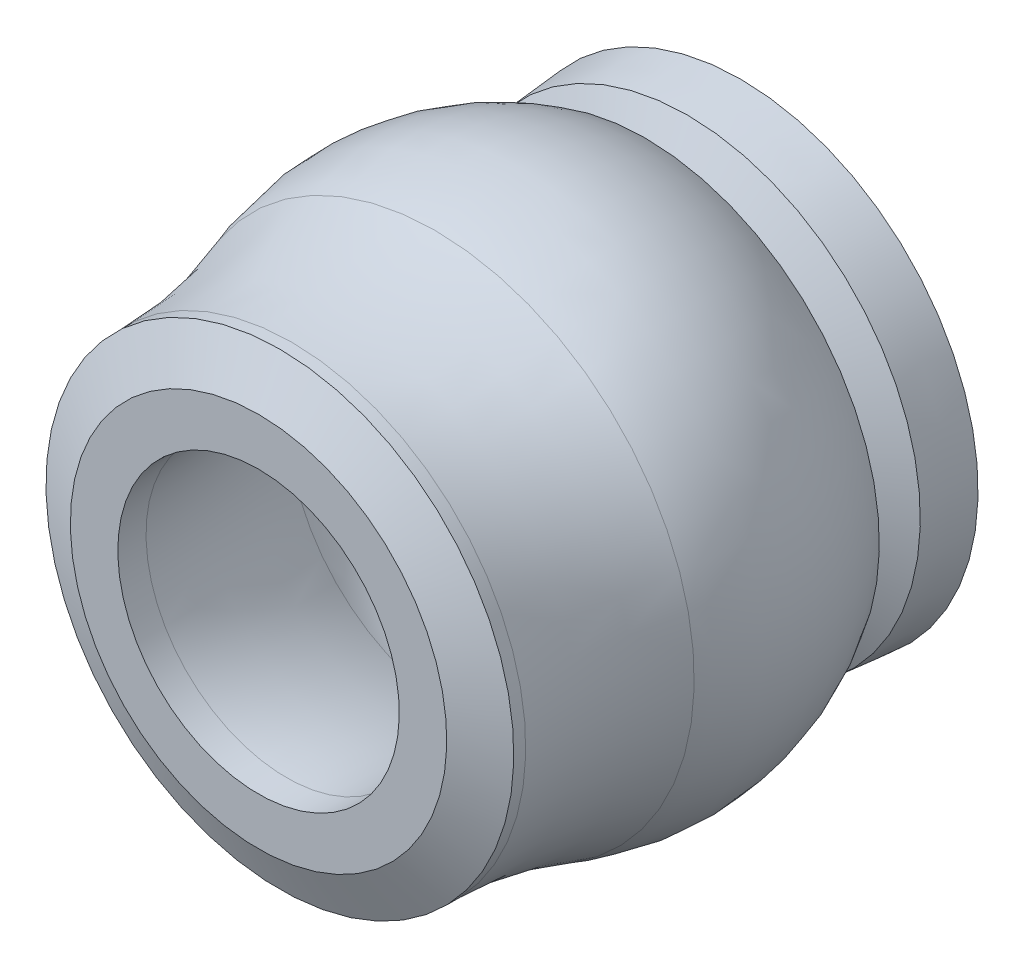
ISO-10303-21;
HEADER;
FILE_DESCRIPTION(('STEP AP214'),'2;1');
FILE_NAME('part.step','',(''),(''),'','','');
FILE_SCHEMA(('AUTOMOTIVE_DESIGN { 1 0 10303 214 1 1 1 1 }'));
ENDSEC;
DATA;
#1=APPLICATION_CONTEXT('core data for automotive mechanical design processes');
#2=APPLICATION_PROTOCOL_DEFINITION('international standard','automotive_design',2000,#1);
#3=PRODUCT_CONTEXT('',#1,'mechanical');
#4=PRODUCT('Part','Part','',(#3));
#5=PRODUCT_RELATED_PRODUCT_CATEGORY('part','',(#4));
#6=PRODUCT_DEFINITION_FORMATION('','',#4);
#7=PRODUCT_DEFINITION_CONTEXT('part definition',#1,'design');
#8=PRODUCT_DEFINITION('design','',#6,#7);
#9=PRODUCT_DEFINITION_SHAPE('','',#8);
#10=(LENGTH_UNIT() NAMED_UNIT(*) SI_UNIT(.MILLI.,.METRE.));
#11=(NAMED_UNIT(*) PLANE_ANGLE_UNIT() SI_UNIT($,.RADIAN.));
#12=(NAMED_UNIT(*) SI_UNIT($,.STERADIAN.) SOLID_ANGLE_UNIT());
#13=UNCERTAINTY_MEASURE_WITH_UNIT(LENGTH_MEASURE(1.E-05),#10,'distance_accuracy_value','');
#14=(GEOMETRIC_REPRESENTATION_CONTEXT(3) GLOBAL_UNCERTAINTY_ASSIGNED_CONTEXT((#13)) GLOBAL_UNIT_ASSIGNED_CONTEXT((#10,
#11,#12)) REPRESENTATION_CONTEXT('',''));
#15=CARTESIAN_POINT('',(0.,0.,0.));
#16=DIRECTION('',(0.,0.,1.));
#17=DIRECTION('',(1.,0.,0.));
#18=AXIS2_PLACEMENT_3D('',#15,#16,#17);
#19=CARTESIAN_POINT('',(0.,0.,7.8471037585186));
#20=DIRECTION('',(0.,0.,-1.));
#21=DIRECTION('',(0.,1.,0.));
#22=AXIS2_PLACEMENT_3D('',#19,#20,#21);
#23=TOROIDAL_SURFACE('',#22,11.684,1.524);
#24=CARTESIAN_POINT('',(0.,0.,7.8471037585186));
#25=DIRECTION('',(0.,0.,-1.));
#26=DIRECTION('',(0.,1.,0.));
#27=AXIS2_PLACEMENT_3D('',#24,#25,#26);
#28=CIRCLE('',#27,10.16);
#29=CARTESIAN_POINT('',(0.,10.16,7.8471037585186));
#30=VERTEX_POINT('',#29);
#31=EDGE_CURVE('E97',#30,#30,#28,.T.);
#32=ORIENTED_EDGE('',*,*,#31,.T.);
#33=EDGE_LOOP('',(#32));
#34=FACE_BOUND('',#33,.T.);
#35=CARTESIAN_POINT('',(0.,0.,8.77564605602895));
#36=DIRECTION('',(0.,0.,-1.));
#37=DIRECTION('',(0.,1.,0.));
#38=AXIS2_PLACEMENT_3D('',#35,#36,#37);
#39=CIRCLE('',#38,10.4755360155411);
#40=CARTESIAN_POINT('',(0.,10.4755360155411,8.77564605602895));
#41=VERTEX_POINT('',#40);
#42=EDGE_CURVE('E158',#41,#41,#39,.F.);
#43=ORIENTED_EDGE('',*,*,#42,.T.);
#44=EDGE_LOOP('',(#43));
#45=FACE_BOUND('',#44,.T.);
#46=ADVANCED_FACE('F12',(#34,#45),#23,.T.);
#47=CARTESIAN_POINT('',(0.,0.740127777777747,16.256));
#48=DIRECTION('',(1.,0.,0.));
#49=DIRECTION('',(0.,1.,0.));
#50=AXIS2_PLACEMENT_3D('',#47,#48,#49);
#51=CIRCLE('',#50,12.2773722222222);
#52=TRIMMED_CURVE('',#51,(PARAMETER_VALUE(-1.63111679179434)),
(PARAMETER_VALUE(1.63111679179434)),.T.,.PARAMETER.);
#53=CARTESIAN_POINT('',(0.,0.,16.256));
#54=DIRECTION('',(0.,0.,-1.));
#55=AXIS1_PLACEMENT('',#53,#54);
#56=SURFACE_OF_REVOLUTION('',#52,#55);
#57=ORIENTED_EDGE('',*,*,#42,.F.);
#58=EDGE_LOOP('',(#57));
#59=FACE_BOUND('',#58,.T.);
#60=CARTESIAN_POINT('',(0.,0.,20.3829451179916));
#61=DIRECTION('',(0.,0.,-1.));
#62=DIRECTION('',(0.,1.,0.));
#63=AXIS2_PLACEMENT_3D('',#60,#61,#62);
#64=CIRCLE('',#63,12.3030942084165);
#65=CARTESIAN_POINT('',(0.,12.3030942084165,20.3829451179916));
#66=VERTEX_POINT('',#65);
#67=EDGE_CURVE('E94',#66,#66,#64,.T.);
#68=ORIENTED_EDGE('',*,*,#67,.F.);
#69=EDGE_LOOP('',(#68));
#70=FACE_BOUND('',#69,.T.);
#71=ADVANCED_FACE('F101',(#59,#70),#56,.T.);
#72=CARTESIAN_POINT('',(0.,0.,-13.2937769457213));
#73=DIRECTION('',(0.,0.,-1.));
#74=DIRECTION('',(0.,1.,0.));
#75=AXIS2_PLACEMENT_3D('',#72,#73,#74);
#76=CYLINDRICAL_SURFACE('',#75,10.16);
#77=CARTESIAN_POINT('',(0.,0.,7.58440075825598));
#78=DIRECTION('',(0.,0.,1.));
#79=DIRECTION('',(0.,-1.,0.));
#80=AXIS2_PLACEMENT_3D('',#77,#78,#79);
#81=CIRCLE('',#80,10.16);
#82=CARTESIAN_POINT('',(0.,-10.16,7.58440075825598));
#83=VERTEX_POINT('',#82);
#84=EDGE_CURVE('E91',#83,#83,#81,.F.);
#85=ORIENTED_EDGE('',*,*,#84,.T.);
#86=EDGE_LOOP('',(#85));
#87=FACE_BOUND('',#86,.T.);
#88=ORIENTED_EDGE('',*,*,#31,.F.);
#89=EDGE_LOOP('',(#88));
#90=FACE_BOUND('',#89,.T.);
#91=ADVANCED_FACE('F84',(#87,#90),#76,.F.);
#92=CARTESIAN_POINT('',(0.,0.,32.7630689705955));
#93=DIRECTION('',(0.,0.,-1.));
#94=DIRECTION('',(0.,1.,0.));
#95=AXIS2_PLACEMENT_3D('',#92,#93,#94);
#96=TOROIDAL_SURFACE('',#95,46.99,36.83);
#97=ORIENTED_EDGE('',*,*,#67,.T.);
#98=EDGE_LOOP('',(#97));
#99=FACE_BOUND('',#98,.T.);
#100=CARTESIAN_POINT('',(0.,0.,32.7630689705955));
#101=DIRECTION('',(0.,0.,-1.));
#102=DIRECTION('',(0.,1.,0.));
#103=AXIS2_PLACEMENT_3D('',#100,#101,#102);
#104=CIRCLE('',#103,10.16);
#105=CARTESIAN_POINT('',(0.,10.16,32.7630689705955));
#106=VERTEX_POINT('',#105);
#107=EDGE_CURVE('E89',#106,#106,#104,.F.);
#108=ORIENTED_EDGE('',*,*,#107,.T.);
#109=EDGE_LOOP('',(#108));
#110=FACE_BOUND('',#109,.T.);
#111=ADVANCED_FACE('F79',(#99,#110),#96,.T.);
#112=CARTESIAN_POINT('',(0.,0.,7.58440075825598));
#113=DIRECTION('',(0.,0.,1.));
#114=DIRECTION('',(0.,-1.,0.));
#115=AXIS2_PLACEMENT_3D('',#112,#113,#114);
#116=CONICAL_SURFACE('',#115,10.16,1.13446401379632);
#117=ORIENTED_EDGE('',*,*,#84,.F.);
#118=EDGE_LOOP('',(#117));
#119=FACE_BOUND('',#118,.T.);
#120=CARTESIAN_POINT('',(0.,0.,5.334));
#121=DIRECTION('',(0.,0.,-1.));
#122=DIRECTION('',(0.,1.,0.));
#123=AXIS2_PLACEMENT_3D('',#120,#121,#122);
#124=CIRCLE('',#123,5.334);
#125=CARTESIAN_POINT('',(0.,5.334,5.334));
#126=VERTEX_POINT('',#125);
#127=EDGE_CURVE('E138',#126,#126,#124,.T.);
#128=ORIENTED_EDGE('',*,*,#127,.T.);
#129=EDGE_LOOP('',(#128));
#130=FACE_BOUND('',#129,.T.);
#131=ADVANCED_FACE('F75',(#119,#130),#116,.F.);
#132=CARTESIAN_POINT('',(0.,0.,-13.2937769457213));
#133=DIRECTION('',(0.,0.,-1.));
#134=DIRECTION('',(0.,1.,0.));
#135=AXIS2_PLACEMENT_3D('',#132,#133,#134);
#136=CYLINDRICAL_SURFACE('',#135,10.16);
#137=ORIENTED_EDGE('',*,*,#107,.F.);
#138=EDGE_LOOP('',(#137));
#139=FACE_BOUND('',#138,.T.);
#140=CARTESIAN_POINT('',(0.,0.,34.798));
#141=DIRECTION('',(0.,0.,-1.));
#142=DIRECTION('',(0.,1.,0.));
#143=AXIS2_PLACEMENT_3D('',#140,#141,#142);
#144=CIRCLE('',#143,10.16);
#145=CARTESIAN_POINT('',(0.,10.16,34.798));
#146=VERTEX_POINT('',#145);
#147=EDGE_CURVE('E16',#146,#146,#144,.T.);
#148=ORIENTED_EDGE('',*,*,#147,.F.);
#149=EDGE_LOOP('',(#148));
#150=FACE_BOUND('',#149,.T.);
#151=ADVANCED_FACE('F71',(#139,#150),#136,.F.);
#152=CARTESIAN_POINT('',(0.,0.,-13.2937769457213));
#153=DIRECTION('',(0.,0.,-1.));
#154=DIRECTION('',(0.,1.,0.));
#155=AXIS2_PLACEMENT_3D('',#152,#153,#154);
#156=CYLINDRICAL_SURFACE('',#155,5.334);
#157=CARTESIAN_POINT('',(0.,0.,0.));
#158=DIRECTION('',(0.,0.,-1.));
#159=DIRECTION('',(0.,1.,0.));
#160=AXIS2_PLACEMENT_3D('',#157,#158,#159);
#161=CIRCLE('',#160,5.334);
#162=CARTESIAN_POINT('',(0.,5.334,0.));
#163=VERTEX_POINT('',#162);
#164=EDGE_CURVE('E143',#163,#163,#161,.F.);
#165=ORIENTED_EDGE('',*,*,#164,.F.);
#166=EDGE_LOOP('',(#165));
#167=FACE_BOUND('',#166,.T.);
#168=ORIENTED_EDGE('',*,*,#127,.F.);
#169=EDGE_LOOP('',(#168));
#170=FACE_BOUND('',#169,.T.);
#171=ADVANCED_FACE('F67',(#167,#170),#156,.F.);
#172=CARTESIAN_POINT('',(13.589,0.,34.798));
#173=DIRECTION('',(0.,0.,1.));
#174=DIRECTION('',(0.,-1.,0.));
#175=AXIS2_PLACEMENT_3D('',#172,#173,#174);
#176=PLANE('',#175);
#177=CARTESIAN_POINT('',(0.,0.,34.798));
#178=DIRECTION('',(0.,0.,-1.));
#179=DIRECTION('',(0.,1.,0.));
#180=AXIS2_PLACEMENT_3D('',#177,#178,#179);
#181=CIRCLE('',#180,13.589);
#182=CARTESIAN_POINT('',(0.,13.589,34.798));
#183=VERTEX_POINT('',#182);
#184=EDGE_CURVE('E151',#183,#183,#181,.T.);
#185=ORIENTED_EDGE('',*,*,#184,.F.);
#186=EDGE_LOOP('',(#185));
#187=FACE_BOUND('',#186,.T.);
#188=ORIENTED_EDGE('',*,*,#147,.T.);
#189=EDGE_LOOP('',(#188));
#190=FACE_BOUND('',#189,.T.);
#191=ADVANCED_FACE('F63',(#187,#190),#176,.T.);
#192=CARTESIAN_POINT('',(5.334,0.,0.));
#193=DIRECTION('',(0.,0.,-1.));
#194=DIRECTION('',(0.,1.,0.));
#195=AXIS2_PLACEMENT_3D('',#192,#193,#194);
#196=PLANE('',#195);
#197=ORIENTED_EDGE('',*,*,#164,.T.);
#198=EDGE_LOOP('',(#197));
#199=FACE_BOUND('',#198,.T.);
#200=CARTESIAN_POINT('',(0.,0.,0.));
#201=DIRECTION('',(0.,0.,-1.));
#202=DIRECTION('',(0.,1.,0.));
#203=AXIS2_PLACEMENT_3D('',#200,#201,#202);
#204=CIRCLE('',#203,17.145);
#205=CARTESIAN_POINT('',(0.,17.145,0.));
#206=VERTEX_POINT('',#205);
#207=EDGE_CURVE('E136',#206,#206,#204,.F.);
#208=ORIENTED_EDGE('',*,*,#207,.F.);
#209=EDGE_LOOP('',(#208));
#210=FACE_BOUND('',#209,.T.);
#211=ADVANCED_FACE('F59',(#199,#210),#196,.T.);
#212=CARTESIAN_POINT('',(0.,0.,33.2582521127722));
#213=DIRECTION('',(0.,0.,-1.));
#214=DIRECTION('',(0.,1.,0.));
#215=AXIS2_PLACEMENT_3D('',#212,#213,#214);
#216=CONICAL_SURFACE('',#215,16.891,1.13446401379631);
#217=ORIENTED_EDGE('',*,*,#184,.T.);
#218=EDGE_LOOP('',(#217));
#219=FACE_BOUND('',#218,.T.);
#220=CARTESIAN_POINT('',(0.,0.,33.2582521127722));
#221=DIRECTION('',(0.,0.,-1.));
#222=DIRECTION('',(0.,1.,0.));
#223=AXIS2_PLACEMENT_3D('',#220,#221,#222);
#224=CIRCLE('',#223,16.891);
#225=CARTESIAN_POINT('',(0.,16.891,33.2582521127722));
#226=VERTEX_POINT('',#225);
#227=EDGE_CURVE('E133',#226,#226,#224,.T.);
#228=ORIENTED_EDGE('',*,*,#227,.F.);
#229=EDGE_LOOP('',(#228));
#230=FACE_BOUND('',#229,.T.);
#231=ADVANCED_FACE('F55',(#219,#230),#216,.T.);
#232=CARTESIAN_POINT('',(0.,0.,0.));
#233=DIRECTION('',(0.,0.,-1.));
#234=DIRECTION('',(0.,1.,0.));
#235=AXIS2_PLACEMENT_3D('',#232,#233,#234);
#236=CONICAL_SURFACE('',#235,17.145,0.08726646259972);
#237=CARTESIAN_POINT('',(0.,0.,3.83214873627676));
#238=DIRECTION('',(0.,0.,-1.));
#239=DIRECTION('',(0.,1.,0.));
#240=AXIS2_PLACEMENT_3D('',#237,#238,#239);
#241=CIRCLE('',#240,16.8097304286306);
#242=CARTESIAN_POINT('',(0.,16.8097304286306,3.83214873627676));
#243=VERTEX_POINT('',#242);
#244=EDGE_CURVE('E132',#243,#243,#241,.F.);
#245=ORIENTED_EDGE('',*,*,#244,.F.);
#246=EDGE_LOOP('',(#245));
#247=FACE_BOUND('',#246,.T.);
#248=ORIENTED_EDGE('',*,*,#207,.T.);
#249=EDGE_LOOP('',(#248));
#250=FACE_BOUND('',#249,.T.);
#251=ADVANCED_FACE('F51',(#247,#250),#236,.T.);
#252=CARTESIAN_POINT('',(0.,0.,-13.2937769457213));
#253=DIRECTION('',(0.,0.,-1.));
#254=DIRECTION('',(0.,1.,0.));
#255=AXIS2_PLACEMENT_3D('',#252,#253,#254);
#256=CYLINDRICAL_SURFACE('',#255,16.891);
#257=ORIENTED_EDGE('',*,*,#227,.T.);
#258=EDGE_LOOP('',(#257));
#259=FACE_BOUND('',#258,.T.);
#260=CARTESIAN_POINT('',(0.,0.,32.3960990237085));
#261=DIRECTION('',(0.,0.,-1.));
#262=DIRECTION('',(0.,1.,0.));
#263=AXIS2_PLACEMENT_3D('',#260,#261,#262);
#264=CIRCLE('',#263,16.891);
#265=CARTESIAN_POINT('',(0.,16.891,32.3960990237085));
#266=VERTEX_POINT('',#265);
#267=EDGE_CURVE('E32',#266,#266,#264,.F.);
#268=ORIENTED_EDGE('',*,*,#267,.T.);
#269=EDGE_LOOP('',(#268));
#270=FACE_BOUND('',#269,.T.);
#271=ADVANCED_FACE('F47',(#259,#270),#256,.T.);
#272=CARTESIAN_POINT('',(0.,0.,3.83214873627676));
#273=DIRECTION('',(0.,0.,-1.));
#274=DIRECTION('',(0.,1.,0.));
#275=AXIS2_PLACEMENT_3D('',#272,#273,#274);
#276=CONICAL_SURFACE('',#275,16.8097304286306,1.13446401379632);
#277=CARTESIAN_POINT('',(0.,0.,5.334));
#278=DIRECTION('',(0.,0.,1.));
#279=DIRECTION('',(0.,-1.,0.));
#280=AXIS2_PLACEMENT_3D('',#277,#278,#279);
#281=CIRCLE('',#280,13.589);
#282=CARTESIAN_POINT('',(0.,-13.589,5.334));
#283=VERTEX_POINT('',#282);
#284=EDGE_CURVE('E25',#283,#283,#281,.T.);
#285=ORIENTED_EDGE('',*,*,#284,.F.);
#286=EDGE_LOOP('',(#285));
#287=FACE_BOUND('',#286,.T.);
#288=ORIENTED_EDGE('',*,*,#244,.T.);
#289=EDGE_LOOP('',(#288));
#290=FACE_BOUND('',#289,.T.);
#291=ADVANCED_FACE('F42',(#287,#290),#276,.T.);
#292=CARTESIAN_POINT('',(0.,0.,32.3960990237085));
#293=DIRECTION('',(0.,0.,-1.));
#294=DIRECTION('',(0.,1.,0.));
#295=AXIS2_PLACEMENT_3D('',#292,#293,#294);
#296=TOROIDAL_SURFACE('',#295,47.371,30.48);
#297=ORIENTED_EDGE('',*,*,#267,.F.);
#298=EDGE_LOOP('',(#297));
#299=FACE_BOUND('',#298,.T.);
#300=CARTESIAN_POINT('',(0.,0.,22.0464764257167));
#301=DIRECTION('',(0.,0.,-1.));
#302=DIRECTION('',(0.,1.,0.));
#303=AXIS2_PLACEMENT_3D('',#300,#301,#302);
#304=CIRCLE('',#303,18.701927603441);
#305=CARTESIAN_POINT('',(0.,18.701927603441,22.0464764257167));
#306=VERTEX_POINT('',#305);
#307=EDGE_CURVE('E20',#306,#306,#304,.T.);
#308=ORIENTED_EDGE('',*,*,#307,.F.);
#309=EDGE_LOOP('',(#308));
#310=FACE_BOUND('',#309,.T.);
#311=ADVANCED_FACE('F37',(#299,#310),#296,.F.);
#312=CARTESIAN_POINT('',(0.,0.,6.87374788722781));
#313=DIRECTION('',(0.,0.,1.));
#314=DIRECTION('',(-1.,0.,0.));
#315=AXIS2_PLACEMENT_3D('',#312,#313,#314);
#316=CONICAL_SURFACE('',#315,16.891,1.13446401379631);
#317=ORIENTED_EDGE('',*,*,#284,.T.);
#318=EDGE_LOOP('',(#317));
#319=FACE_BOUND('',#318,.T.);
#320=CARTESIAN_POINT('',(0.,0.,6.87374788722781));
#321=DIRECTION('',(0.,0.,-1.));
#322=DIRECTION('',(0.,1.,0.));
#323=AXIS2_PLACEMENT_3D('',#320,#321,#322);
#324=CIRCLE('',#323,16.891);
#325=CARTESIAN_POINT('',(0.,16.891,6.87374788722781));
#326=VERTEX_POINT('',#325);
#327=EDGE_CURVE('E8',#326,#326,#324,.F.);
#328=ORIENTED_EDGE('',*,*,#327,.F.);
#329=EDGE_LOOP('',(#328));
#330=FACE_BOUND('',#329,.T.);
#331=ADVANCED_FACE('F41',(#319,#330),#316,.T.);
#332=CARTESIAN_POINT('',(0.,2.68377354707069,16.2638739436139));
#333=DIRECTION('',(1.,0.,0.));
#334=DIRECTION('',(0.,1.,0.));
#335=AXIS2_PLACEMENT_3D('',#332,#333,#334);
#336=CIRCLE('',#335,17.0299662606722);
#337=TRIMMED_CURVE('',#336,(PARAMETER_VALUE(-1.72904726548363)),
(PARAMETER_VALUE(1.72904726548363)),.T.,.PARAMETER.);
#338=CARTESIAN_POINT('',(0.,0.,16.2638739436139));
#339=DIRECTION('',(0.,0.,-1.));
#340=AXIS1_PLACEMENT('',#338,#339);
#341=SURFACE_OF_REVOLUTION('',#337,#340);
#342=ORIENTED_EDGE('',*,*,#307,.T.);
#343=EDGE_LOOP('',(#342));
#344=FACE_BOUND('',#343,.T.);
#345=ORIENTED_EDGE('',*,*,#327,.T.);
#346=EDGE_LOOP('',(#345));
#347=FACE_BOUND('',#346,.T.);
#348=ADVANCED_FACE('F114',(#344,#347),#341,.F.);
#349=CLOSED_SHELL('',(#46,#71,#91,#111,#131,#151,#171,#191,#211,#231,#251,#271,#291,#311,#331,#348));
#350=MANIFOLD_SOLID_BREP('B1',#349);
#351=ADVANCED_BREP_SHAPE_REPRESENTATION('',(#18,#350),#14);
#352=SHAPE_DEFINITION_REPRESENTATION(#9,#351);
ENDSEC;
END-ISO-10303-21;
